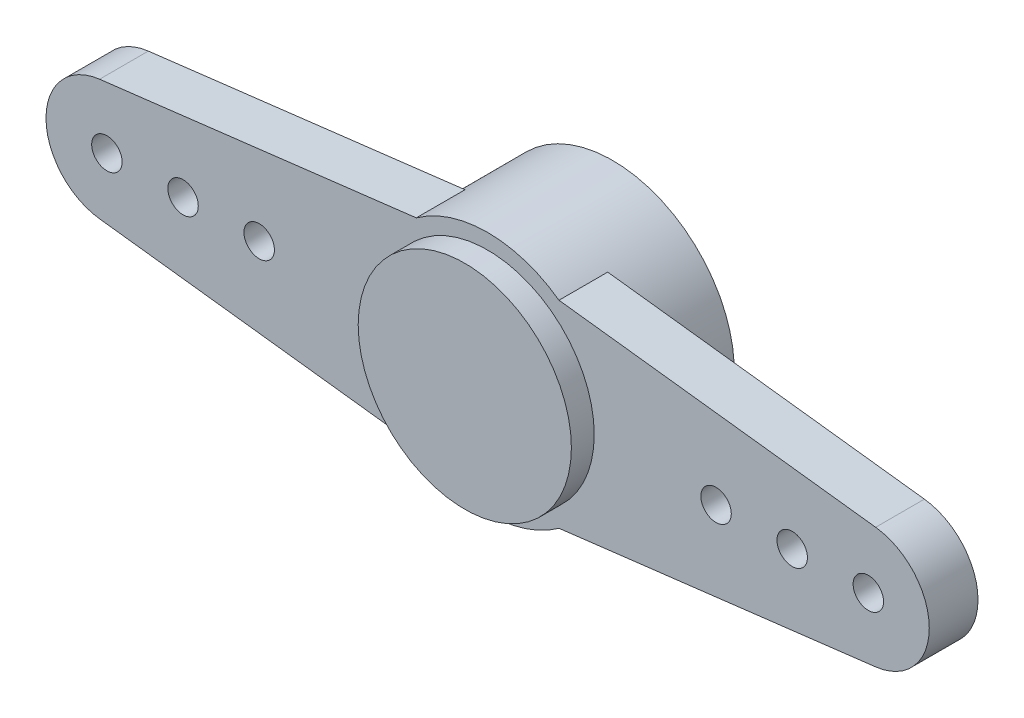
from build123d import *

# Parameters (mm, degrees)
ESQUISSE1_R                  = 0.5000000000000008
EXTRUSION6_DEPTH             = 1.6
ESQUISSE2_R                  = 3.5
EXTRUSION7_DEPTH             = 0.75
ESQUISSE3_R                  = 4
EXTRUSION8_DEPTH             = 2.5
EXTRUSION8_DIRECTION_2_REACH = 17.1
ESQUISSE4_R                  = 2.9
EXTRUSION9_DEPTH             = 2.7


with BuildPart() as part:
    # Esquisse1 → Extrusion6 (new body)
    with BuildSketch(Plane.XY):
        with BuildLine():
            Line((-12.740000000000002, 1.985547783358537), (-0.41999999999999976, 3.4747086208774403))
            ThreePointArc((-0.41999999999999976, 3.4747086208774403), (2.1e-16, 3.5000000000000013), (0.4200000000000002, 3.474708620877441))
            Line((0.4200000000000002, 3.474708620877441), (12.740000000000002, 1.985547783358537))
            ThreePointArc((12.740000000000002, 1.985547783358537), (14.5, 0), (12.740000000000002, -1.985547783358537))
            Line((12.740000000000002, -1.985547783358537), (0.41999999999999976, -3.4747086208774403))
            ThreePointArc((0.41999999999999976, -3.4747086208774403), (2.1e-16, -3.5000000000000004), (-0.41999999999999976, -3.4747086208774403))
            Line((-0.41999999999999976, -3.4747086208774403), (-12.740000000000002, -1.985547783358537))
            ThreePointArc((-12.740000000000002, -1.985547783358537), (-14.5, 2.4e-16), (-12.740000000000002, 1.985547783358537))
        make_face()
        with Locations((-12.5, 0)):
            Circle(ESQUISSE1_R, mode=Mode.SUBTRACT)
        with Locations((-10, 0)):
            Circle(ESQUISSE1_R, mode=Mode.SUBTRACT)
        with Locations((-7.5, 0)):
            Circle(ESQUISSE1_R, mode=Mode.SUBTRACT)
        with Locations((7.5, 0)):
            Circle(ESQUISSE1_R, mode=Mode.SUBTRACT)
        with Locations((10, 0)):
            Circle(ESQUISSE1_R, mode=Mode.SUBTRACT)
        with Locations((12.5, 0)):
            Circle(ESQUISSE1_R, mode=Mode.SUBTRACT)
    extrude(amount=EXTRUSION6_DEPTH)

    # Esquisse2 → Extrusion7 (add)
    with BuildSketch(Plane.XY.offset(1.6)):
        with Locations(Location((0, 0, 0), (0, 0, 96.892102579))):
            Circle(ESQUISSE2_R)
    extrude(amount=EXTRUSION7_DEPTH)

    # Esquisse3 → Extrusion8 (add)
    with BuildSketch(Plane(origin=(0, 0, 0), x_dir=(-1, 0, 0), z_dir=(0, 0, -1))):
        Circle(ESQUISSE3_R)
    extrude(amount=EXTRUSION8_DEPTH)

    # Extrusion8 direction 2: up to this face of the body (flat: up to its plane)
    extrusion8_direction_2_end = Plane(part.part.faces().sort_by_distance((6.561158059, -2.574246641, 1.6))[0])
    # Esquisse3 → Extrusion8 direction 2 (add, up to the picked face)
    with BuildSketch(Plane(origin=(0, 0, 0), x_dir=(-1, 0, 0), z_dir=(0, 0, -1)), mode=Mode.PRIVATE) as extrusion8_direction_2_sk1:
        Circle(ESQUISSE3_R)
    extrusion8_direction_2_tool1 = split(extrude(extrusion8_direction_2_sk1.sketch, amount=-EXTRUSION8_DIRECTION_2_REACH, mode=Mode.PRIVATE), bisect_by=extrusion8_direction_2_end, keep=Keep.BOTH, mode=Mode.PRIVATE)
    add(extrusion8_direction_2_tool1.solids().sort_by(Axis((0, 0, 0), (0, 0, 1)))[0])

    # Esquisse4 → Extrusion9 (cut)
    with BuildSketch(Plane(origin=(0, 0, -2.5), x_dir=(-1, 0, 0), z_dir=(0, 0, -1))):
        Circle(ESQUISSE4_R)
    extrude(amount=-EXTRUSION9_DEPTH, mode=Mode.SUBTRACT)


solid = part.part
